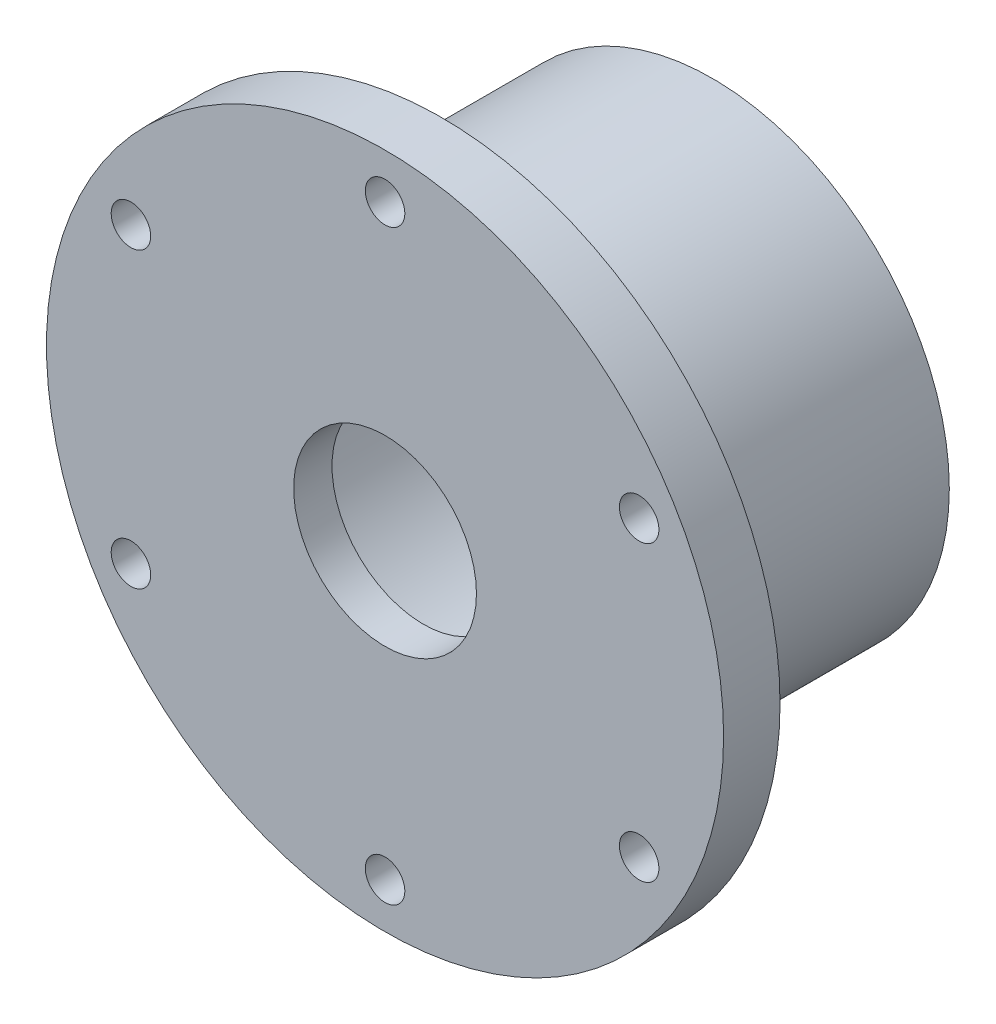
ISO-10303-21;
HEADER;
FILE_DESCRIPTION(('STEP AP214'),'2;1');
FILE_NAME('part.step','',(''),(''),'','','');
FILE_SCHEMA(('AUTOMOTIVE_DESIGN { 1 0 10303 214 1 1 1 1 }'));
ENDSEC;
DATA;
#1=APPLICATION_CONTEXT('core data for automotive mechanical design processes');
#2=APPLICATION_PROTOCOL_DEFINITION('international standard','automotive_design',2000,#1);
#3=PRODUCT_CONTEXT('',#1,'mechanical');
#4=PRODUCT('Part','Part','',(#3));
#5=PRODUCT_RELATED_PRODUCT_CATEGORY('part','',(#4));
#6=PRODUCT_DEFINITION_FORMATION('','',#4);
#7=PRODUCT_DEFINITION_CONTEXT('part definition',#1,'design');
#8=PRODUCT_DEFINITION('design','',#6,#7);
#9=PRODUCT_DEFINITION_SHAPE('','',#8);
#10=(LENGTH_UNIT() NAMED_UNIT(*) SI_UNIT(.MILLI.,.METRE.));
#11=(NAMED_UNIT(*) PLANE_ANGLE_UNIT() SI_UNIT($,.RADIAN.));
#12=(NAMED_UNIT(*) SI_UNIT($,.STERADIAN.) SOLID_ANGLE_UNIT());
#13=UNCERTAINTY_MEASURE_WITH_UNIT(LENGTH_MEASURE(1.E-05),#10,'distance_accuracy_value','');
#14=(GEOMETRIC_REPRESENTATION_CONTEXT(3) GLOBAL_UNCERTAINTY_ASSIGNED_CONTEXT((#13)) GLOBAL_UNIT_ASSIGNED_CONTEXT((#10,
#11,#12)) REPRESENTATION_CONTEXT('',''));
#15=CARTESIAN_POINT('',(0.,0.,0.));
#16=DIRECTION('',(0.,0.,1.));
#17=DIRECTION('',(1.,0.,0.));
#18=AXIS2_PLACEMENT_3D('',#15,#16,#17);
#19=CARTESIAN_POINT('',(0.,0.,0.));
#20=DIRECTION('',(0.,0.,1.));
#21=DIRECTION('',(1.,0.,0.));
#22=AXIS2_PLACEMENT_3D('',#19,#20,#21);
#23=CYLINDRICAL_SURFACE('',#22,69.5);
#24=CARTESIAN_POINT('',(0.,0.,-22.));
#25=DIRECTION('',(0.,0.,1.));
#26=DIRECTION('',(1.,0.,0.));
#27=AXIS2_PLACEMENT_3D('',#24,#25,#26);
#28=CIRCLE('',#27,69.5);
#29=CARTESIAN_POINT('',(69.5,0.,-22.));
#30=VERTEX_POINT('',#29);
#31=EDGE_CURVE('E11',#30,#30,#28,.T.);
#32=ORIENTED_EDGE('',*,*,#31,.F.);
#33=EDGE_LOOP('',(#32));
#34=FACE_BOUND('',#33,.T.);
#35=CARTESIAN_POINT('',(0.,0.,-17.));
#36=DIRECTION('',(0.,0.,1.));
#37=DIRECTION('',(1.,0.,0.));
#38=AXIS2_PLACEMENT_3D('',#35,#36,#37);
#39=CIRCLE('',#38,69.5);
#40=CARTESIAN_POINT('',(69.5,0.,-17.));
#41=VERTEX_POINT('',#40);
#42=EDGE_CURVE('E110',#41,#41,#39,.T.);
#43=ORIENTED_EDGE('',*,*,#42,.T.);
#44=EDGE_LOOP('',(#43));
#45=FACE_BOUND('',#44,.T.);
#46=ADVANCED_FACE('F36',(#34,#45),#23,.F.);
#47=CARTESIAN_POINT('',(0.,69.5,-22.));
#48=DIRECTION('',(0.,0.,1.));
#49=DIRECTION('',(1.,0.,0.));
#50=AXIS2_PLACEMENT_3D('',#47,#48,#49);
#51=PLANE('',#50);
#52=CARTESIAN_POINT('',(0.,0.,-22.));
#53=DIRECTION('',(0.,0.,1.));
#54=DIRECTION('',(1.,0.,0.));
#55=AXIS2_PLACEMENT_3D('',#52,#53,#54);
#56=CIRCLE('',#55,79.5);
#57=CARTESIAN_POINT('',(79.5,0.,-22.));
#58=VERTEX_POINT('',#57);
#59=EDGE_CURVE('E44',#58,#58,#56,.T.);
#60=ORIENTED_EDGE('',*,*,#59,.F.);
#61=EDGE_LOOP('',(#60));
#62=FACE_BOUND('',#61,.T.);
#63=ORIENTED_EDGE('',*,*,#31,.T.);
#64=EDGE_LOOP('',(#63));
#65=FACE_BOUND('',#64,.T.);
#66=ADVANCED_FACE('F139',(#62,#65),#51,.F.);
#67=CARTESIAN_POINT('',(0.,0.,0.));
#68=DIRECTION('',(0.,0.,1.));
#69=DIRECTION('',(1.,0.,0.));
#70=AXIS2_PLACEMENT_3D('',#67,#68,#69);
#71=CYLINDRICAL_SURFACE('',#70,79.5);
#72=CARTESIAN_POINT('',(0.,0.,-145.));
#73=DIRECTION('',(0.,0.,1.));
#74=DIRECTION('',(1.,0.,0.));
#75=AXIS2_PLACEMENT_3D('',#72,#73,#74);
#76=CIRCLE('',#75,79.5);
#77=CARTESIAN_POINT('',(79.5,0.,-145.));
#78=VERTEX_POINT('',#77);
#79=EDGE_CURVE('E131',#78,#78,#76,.T.);
#80=ORIENTED_EDGE('',*,*,#79,.F.);
#81=EDGE_LOOP('',(#80));
#82=FACE_BOUND('',#81,.T.);
#83=ORIENTED_EDGE('',*,*,#59,.T.);
#84=EDGE_LOOP('',(#83));
#85=FACE_BOUND('',#84,.T.);
#86=ADVANCED_FACE('F137',(#82,#85),#71,.F.);
#87=CARTESIAN_POINT('',(0.,105.,-145.));
#88=DIRECTION('',(0.,0.,1.));
#89=DIRECTION('',(1.,0.,0.));
#90=AXIS2_PLACEMENT_3D('',#87,#88,#89);
#91=PLANE('',#90);
#92=CARTESIAN_POINT('',(77.942286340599,45.0000000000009,-145.));
#93=DIRECTION('',(0.,0.,-1.));
#94=DIRECTION('',(-1.,0.,0.));
#95=AXIS2_PLACEMENT_3D('',#92,#93,#94);
#96=CIRCLE('',#95,3.39999999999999);
#97=CARTESIAN_POINT('',(74.542286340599,45.0000000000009,-145.));
#98=VERTEX_POINT('',#97);
#99=EDGE_CURVE('E74',#98,#98,#96,.T.);
#100=ORIENTED_EDGE('',*,*,#99,.F.);
#101=EDGE_LOOP('',(#100));
#102=FACE_BOUND('',#101,.T.);
#103=CARTESIAN_POINT('',(77.9422863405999,-44.9999999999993,-145.));
#104=DIRECTION('',(0.,0.,-1.));
#105=DIRECTION('',(-1.,0.,0.));
#106=AXIS2_PLACEMENT_3D('',#103,#104,#105);
#107=CIRCLE('',#106,3.39999999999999);
#108=CARTESIAN_POINT('',(74.5422863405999,-44.9999999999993,-145.));
#109=VERTEX_POINT('',#108);
#110=EDGE_CURVE('E73',#109,#109,#107,.T.);
#111=ORIENTED_EDGE('',*,*,#110,.F.);
#112=EDGE_LOOP('',(#111));
#113=FACE_BOUND('',#112,.T.);
#114=CARTESIAN_POINT('',(0.,-90.,-145.));
#115=DIRECTION('',(0.,0.,-1.));
#116=DIRECTION('',(-1.,0.,0.));
#117=AXIS2_PLACEMENT_3D('',#114,#115,#116);
#118=CIRCLE('',#117,3.39999999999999);
#119=CARTESIAN_POINT('',(-3.39999999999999,-90.,-145.));
#120=VERTEX_POINT('',#119);
#121=EDGE_CURVE('E86',#120,#120,#118,.T.);
#122=ORIENTED_EDGE('',*,*,#121,.F.);
#123=EDGE_LOOP('',(#122));
#124=FACE_BOUND('',#123,.T.);
#125=CARTESIAN_POINT('',(-77.9422863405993,-45.0000000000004,-145.));
#126=DIRECTION('',(0.,0.,-1.));
#127=DIRECTION('',(-1.,0.,0.));
#128=AXIS2_PLACEMENT_3D('',#125,#126,#127);
#129=CIRCLE('',#128,3.39999999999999);
#130=CARTESIAN_POINT('',(-81.3422863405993,-45.0000000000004,-145.));
#131=VERTEX_POINT('',#130);
#132=EDGE_CURVE('E92',#131,#131,#129,.T.);
#133=ORIENTED_EDGE('',*,*,#132,.F.);
#134=EDGE_LOOP('',(#133));
#135=FACE_BOUND('',#134,.T.);
#136=CARTESIAN_POINT('',(-77.9422863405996,44.9999999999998,-145.));
#137=DIRECTION('',(0.,0.,-1.));
#138=DIRECTION('',(-1.,0.,0.));
#139=AXIS2_PLACEMENT_3D('',#136,#137,#138);
#140=CIRCLE('',#139,3.39999999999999);
#141=CARTESIAN_POINT('',(-81.3422863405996,44.9999999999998,-145.));
#142=VERTEX_POINT('',#141);
#143=EDGE_CURVE('E98',#142,#142,#140,.T.);
#144=ORIENTED_EDGE('',*,*,#143,.F.);
#145=EDGE_LOOP('',(#144));
#146=FACE_BOUND('',#145,.T.);
#147=CARTESIAN_POINT('',(0.,90.,-145.));
#148=DIRECTION('',(0.,0.,-1.));
#149=DIRECTION('',(-1.,0.,0.));
#150=AXIS2_PLACEMENT_3D('',#147,#148,#149);
#151=CIRCLE('',#150,3.39999999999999);
#152=CARTESIAN_POINT('',(-3.39999999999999,90.,-145.));
#153=VERTEX_POINT('',#152);
#154=EDGE_CURVE('E104',#153,#153,#151,.T.);
#155=ORIENTED_EDGE('',*,*,#154,.F.);
#156=EDGE_LOOP('',(#155));
#157=FACE_BOUND('',#156,.T.);
#158=CARTESIAN_POINT('',(0.,0.,-145.));
#159=DIRECTION('',(0.,0.,1.));
#160=DIRECTION('',(1.,0.,0.));
#161=AXIS2_PLACEMENT_3D('',#158,#159,#160);
#162=CIRCLE('',#161,105.);
#163=CARTESIAN_POINT('',(105.,0.,-145.));
#164=VERTEX_POINT('',#163);
#165=EDGE_CURVE('E128',#164,#164,#162,.T.);
#166=ORIENTED_EDGE('',*,*,#165,.F.);
#167=EDGE_LOOP('',(#166));
#168=FACE_BOUND('',#167,.T.);
#169=ORIENTED_EDGE('',*,*,#79,.T.);
#170=EDGE_LOOP('',(#169));
#171=FACE_BOUND('',#170,.T.);
#172=ADVANCED_FACE('F184',(#102,#113,#124,#135,#146,#157,#168,#171),#91,.F.);
#173=CARTESIAN_POINT('',(0.,0.,0.));
#174=DIRECTION('',(0.,0.,1.));
#175=DIRECTION('',(1.,0.,0.));
#176=AXIS2_PLACEMENT_3D('',#173,#174,#175);
#177=CYLINDRICAL_SURFACE('',#176,105.);
#178=CARTESIAN_POINT('',(0.,0.,-25.));
#179=DIRECTION('',(0.,0.,1.));
#180=DIRECTION('',(1.,0.,0.));
#181=AXIS2_PLACEMENT_3D('',#178,#179,#180);
#182=CIRCLE('',#181,105.);
#183=CARTESIAN_POINT('',(105.,0.,-25.));
#184=VERTEX_POINT('',#183);
#185=EDGE_CURVE('E125',#184,#184,#182,.T.);
#186=ORIENTED_EDGE('',*,*,#185,.F.);
#187=EDGE_LOOP('',(#186));
#188=FACE_BOUND('',#187,.T.);
#189=ORIENTED_EDGE('',*,*,#165,.T.);
#190=EDGE_LOOP('',(#189));
#191=FACE_BOUND('',#190,.T.);
#192=ADVANCED_FACE('F177',(#188,#191),#177,.T.);
#193=CARTESIAN_POINT('',(0.,150.,-25.));
#194=DIRECTION('',(0.,0.,1.));
#195=DIRECTION('',(1.,0.,0.));
#196=AXIS2_PLACEMENT_3D('',#193,#194,#195);
#197=PLANE('',#196);
#198=CARTESIAN_POINT('',(112.583302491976,65.0000000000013,-25.));
#199=DIRECTION('',(0.,0.,-1.));
#200=DIRECTION('',(-1.,0.,0.));
#201=AXIS2_PLACEMENT_3D('',#198,#199,#200);
#202=CIRCLE('',#201,8.74999999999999);
#203=CARTESIAN_POINT('',(103.833302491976,65.0000000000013,-25.));
#204=VERTEX_POINT('',#203);
#205=EDGE_CURVE('E265',#204,#204,#202,.T.);
#206=ORIENTED_EDGE('',*,*,#205,.F.);
#207=EDGE_LOOP('',(#206));
#208=FACE_BOUND('',#207,.T.);
#209=CARTESIAN_POINT('',(112.583302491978,-64.999999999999,-25.));
#210=DIRECTION('',(0.,0.,-1.));
#211=DIRECTION('',(-1.,0.,0.));
#212=AXIS2_PLACEMENT_3D('',#209,#210,#211);
#213=CIRCLE('',#212,8.74999999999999);
#214=CARTESIAN_POINT('',(103.833302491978,-64.999999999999,-25.));
#215=VERTEX_POINT('',#214);
#216=EDGE_CURVE('E268',#215,#215,#213,.T.);
#217=ORIENTED_EDGE('',*,*,#216,.F.);
#218=EDGE_LOOP('',(#217));
#219=FACE_BOUND('',#218,.T.);
#220=CARTESIAN_POINT('',(0.,-130.,-25.));
#221=DIRECTION('',(0.,0.,-1.));
#222=DIRECTION('',(-1.,0.,0.));
#223=AXIS2_PLACEMENT_3D('',#220,#221,#222);
#224=CIRCLE('',#223,8.75);
#225=CARTESIAN_POINT('',(-8.75,-130.,-25.));
#226=VERTEX_POINT('',#225);
#227=EDGE_CURVE('E276',#226,#226,#224,.T.);
#228=ORIENTED_EDGE('',*,*,#227,.F.);
#229=EDGE_LOOP('',(#228));
#230=FACE_BOUND('',#229,.T.);
#231=CARTESIAN_POINT('',(-112.583302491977,-65.0000000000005,-25.));
#232=DIRECTION('',(0.,0.,-1.));
#233=DIRECTION('',(-1.,0.,0.));
#234=AXIS2_PLACEMENT_3D('',#231,#232,#233);
#235=CIRCLE('',#234,8.74999999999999);
#236=CARTESIAN_POINT('',(-121.333302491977,-65.0000000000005,-25.));
#237=VERTEX_POINT('',#236);
#238=EDGE_CURVE('E282',#237,#237,#235,.T.);
#239=ORIENTED_EDGE('',*,*,#238,.F.);
#240=EDGE_LOOP('',(#239));
#241=FACE_BOUND('',#240,.T.);
#242=CARTESIAN_POINT('',(-112.583302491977,64.9999999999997,-25.));
#243=DIRECTION('',(0.,0.,-1.));
#244=DIRECTION('',(-1.,0.,0.));
#245=AXIS2_PLACEMENT_3D('',#242,#243,#244);
#246=CIRCLE('',#245,8.74999999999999);
#247=CARTESIAN_POINT('',(-121.333302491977,64.9999999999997,-25.));
#248=VERTEX_POINT('',#247);
#249=EDGE_CURVE('E288',#248,#248,#246,.T.);
#250=ORIENTED_EDGE('',*,*,#249,.F.);
#251=EDGE_LOOP('',(#250));
#252=FACE_BOUND('',#251,.T.);
#253=CARTESIAN_POINT('',(0.,130.,-25.));
#254=DIRECTION('',(0.,0.,-1.));
#255=DIRECTION('',(-1.,0.,0.));
#256=AXIS2_PLACEMENT_3D('',#253,#254,#255);
#257=CIRCLE('',#256,8.75);
#258=CARTESIAN_POINT('',(-8.75,130.,-25.));
#259=VERTEX_POINT('',#258);
#260=EDGE_CURVE('E294',#259,#259,#257,.T.);
#261=ORIENTED_EDGE('',*,*,#260,.F.);
#262=EDGE_LOOP('',(#261));
#263=FACE_BOUND('',#262,.T.);
#264=CARTESIAN_POINT('',(0.,0.,-25.));
#265=DIRECTION('',(0.,0.,1.));
#266=DIRECTION('',(1.,0.,0.));
#267=AXIS2_PLACEMENT_3D('',#264,#265,#266);
#268=CIRCLE('',#267,150.);
#269=CARTESIAN_POINT('',(150.,0.,-25.));
#270=VERTEX_POINT('',#269);
#271=EDGE_CURVE('E122',#270,#270,#268,.T.);
#272=ORIENTED_EDGE('',*,*,#271,.F.);
#273=EDGE_LOOP('',(#272));
#274=FACE_BOUND('',#273,.T.);
#275=ORIENTED_EDGE('',*,*,#185,.T.);
#276=EDGE_LOOP('',(#275));
#277=FACE_BOUND('',#276,.T.);
#278=ADVANCED_FACE('F171',(#208,#219,#230,#241,#252,#263,#274,#277),#197,.F.);
#279=CARTESIAN_POINT('',(0.,0.,0.));
#280=DIRECTION('',(0.,0.,1.));
#281=DIRECTION('',(1.,0.,0.));
#282=AXIS2_PLACEMENT_3D('',#279,#280,#281);
#283=CYLINDRICAL_SURFACE('',#282,150.);
#284=CARTESIAN_POINT('',(0.,0.,0.));
#285=DIRECTION('',(0.,0.,1.));
#286=DIRECTION('',(1.,0.,0.));
#287=AXIS2_PLACEMENT_3D('',#284,#285,#286);
#288=CIRCLE('',#287,150.);
#289=CARTESIAN_POINT('',(150.,0.,0.));
#290=VERTEX_POINT('',#289);
#291=EDGE_CURVE('E119',#290,#290,#288,.T.);
#292=ORIENTED_EDGE('',*,*,#291,.F.);
#293=EDGE_LOOP('',(#292));
#294=FACE_BOUND('',#293,.T.);
#295=ORIENTED_EDGE('',*,*,#271,.T.);
#296=EDGE_LOOP('',(#295));
#297=FACE_BOUND('',#296,.T.);
#298=ADVANCED_FACE('F164',(#294,#297),#283,.T.);
#299=CARTESIAN_POINT('',(0.,150.,0.));
#300=DIRECTION('',(0.,0.,-1.));
#301=DIRECTION('',(-1.,0.,0.));
#302=AXIS2_PLACEMENT_3D('',#299,#300,#301);
#303=PLANE('',#302);
#304=CARTESIAN_POINT('',(112.583302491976,65.0000000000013,0.));
#305=DIRECTION('',(0.,0.,-1.));
#306=DIRECTION('',(-1.,0.,0.));
#307=AXIS2_PLACEMENT_3D('',#304,#305,#306);
#308=CIRCLE('',#307,8.74999999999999);
#309=CARTESIAN_POINT('',(103.833302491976,65.0000000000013,0.));
#310=VERTEX_POINT('',#309);
#311=EDGE_CURVE('E39',#310,#310,#308,.T.);
#312=ORIENTED_EDGE('',*,*,#311,.T.);
#313=EDGE_LOOP('',(#312));
#314=FACE_BOUND('',#313,.T.);
#315=CARTESIAN_POINT('',(112.583302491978,-64.999999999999,0.));
#316=DIRECTION('',(0.,0.,-1.));
#317=DIRECTION('',(-1.,0.,0.));
#318=AXIS2_PLACEMENT_3D('',#315,#316,#317);
#319=CIRCLE('',#318,8.74999999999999);
#320=CARTESIAN_POINT('',(103.833302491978,-64.999999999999,0.));
#321=VERTEX_POINT('',#320);
#322=EDGE_CURVE('E270',#321,#321,#319,.T.);
#323=ORIENTED_EDGE('',*,*,#322,.T.);
#324=EDGE_LOOP('',(#323));
#325=FACE_BOUND('',#324,.T.);
#326=CARTESIAN_POINT('',(0.,-130.,0.));
#327=DIRECTION('',(0.,0.,-1.));
#328=DIRECTION('',(-1.,0.,0.));
#329=AXIS2_PLACEMENT_3D('',#326,#327,#328);
#330=CIRCLE('',#329,8.75);
#331=CARTESIAN_POINT('',(-8.75,-130.,0.));
#332=VERTEX_POINT('',#331);
#333=EDGE_CURVE('E279',#332,#332,#330,.T.);
#334=ORIENTED_EDGE('',*,*,#333,.T.);
#335=EDGE_LOOP('',(#334));
#336=FACE_BOUND('',#335,.T.);
#337=CARTESIAN_POINT('',(-112.583302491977,-65.0000000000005,0.));
#338=DIRECTION('',(0.,0.,-1.));
#339=DIRECTION('',(-1.,0.,0.));
#340=AXIS2_PLACEMENT_3D('',#337,#338,#339);
#341=CIRCLE('',#340,8.74999999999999);
#342=CARTESIAN_POINT('',(-121.333302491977,-65.0000000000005,0.));
#343=VERTEX_POINT('',#342);
#344=EDGE_CURVE('E285',#343,#343,#341,.T.);
#345=ORIENTED_EDGE('',*,*,#344,.T.);
#346=EDGE_LOOP('',(#345));
#347=FACE_BOUND('',#346,.T.);
#348=CARTESIAN_POINT('',(-112.583302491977,64.9999999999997,0.));
#349=DIRECTION('',(0.,0.,-1.));
#350=DIRECTION('',(-1.,0.,0.));
#351=AXIS2_PLACEMENT_3D('',#348,#349,#350);
#352=CIRCLE('',#351,8.74999999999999);
#353=CARTESIAN_POINT('',(-121.333302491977,64.9999999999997,0.));
#354=VERTEX_POINT('',#353);
#355=EDGE_CURVE('E291',#354,#354,#352,.T.);
#356=ORIENTED_EDGE('',*,*,#355,.T.);
#357=EDGE_LOOP('',(#356));
#358=FACE_BOUND('',#357,.T.);
#359=CARTESIAN_POINT('',(0.,130.,0.));
#360=DIRECTION('',(0.,0.,-1.));
#361=DIRECTION('',(-1.,0.,0.));
#362=AXIS2_PLACEMENT_3D('',#359,#360,#361);
#363=CIRCLE('',#362,8.75);
#364=CARTESIAN_POINT('',(-8.75,130.,0.));
#365=VERTEX_POINT('',#364);
#366=EDGE_CURVE('E80',#365,#365,#363,.T.);
#367=ORIENTED_EDGE('',*,*,#366,.T.);
#368=EDGE_LOOP('',(#367));
#369=FACE_BOUND('',#368,.T.);
#370=CARTESIAN_POINT('',(0.,0.,0.));
#371=DIRECTION('',(0.,0.,1.));
#372=DIRECTION('',(1.,0.,0.));
#373=AXIS2_PLACEMENT_3D('',#370,#371,#372);
#374=CIRCLE('',#373,40.5);
#375=CARTESIAN_POINT('',(40.5,0.,0.));
#376=VERTEX_POINT('',#375);
#377=EDGE_CURVE('E116',#376,#376,#374,.T.);
#378=ORIENTED_EDGE('',*,*,#377,.F.);
#379=EDGE_LOOP('',(#378));
#380=FACE_BOUND('',#379,.T.);
#381=ORIENTED_EDGE('',*,*,#291,.T.);
#382=EDGE_LOOP('',(#381));
#383=FACE_BOUND('',#382,.T.);
#384=ADVANCED_FACE('F158',(#314,#325,#336,#347,#358,#369,#380,#383),#303,.F.);
#385=CARTESIAN_POINT('',(0.,0.,0.));
#386=DIRECTION('',(0.,0.,1.));
#387=DIRECTION('',(1.,0.,0.));
#388=AXIS2_PLACEMENT_3D('',#385,#386,#387);
#389=CYLINDRICAL_SURFACE('',#388,40.5);
#390=CARTESIAN_POINT('',(0.,0.,-17.));
#391=DIRECTION('',(0.,0.,1.));
#392=DIRECTION('',(1.,0.,0.));
#393=AXIS2_PLACEMENT_3D('',#390,#391,#392);
#394=CIRCLE('',#393,40.5);
#395=CARTESIAN_POINT('',(40.5,0.,-17.));
#396=VERTEX_POINT('',#395);
#397=EDGE_CURVE('E113',#396,#396,#394,.T.);
#398=ORIENTED_EDGE('',*,*,#397,.F.);
#399=EDGE_LOOP('',(#398));
#400=FACE_BOUND('',#399,.T.);
#401=ORIENTED_EDGE('',*,*,#377,.T.);
#402=EDGE_LOOP('',(#401));
#403=FACE_BOUND('',#402,.T.);
#404=ADVANCED_FACE('F152',(#400,#403),#389,.F.);
#405=CARTESIAN_POINT('',(0.,40.5,-17.));
#406=DIRECTION('',(0.,0.,1.));
#407=DIRECTION('',(1.,0.,0.));
#408=AXIS2_PLACEMENT_3D('',#405,#406,#407);
#409=PLANE('',#408);
#410=ORIENTED_EDGE('',*,*,#42,.F.);
#411=EDGE_LOOP('',(#410));
#412=FACE_BOUND('',#411,.T.);
#413=ORIENTED_EDGE('',*,*,#397,.T.);
#414=EDGE_LOOP('',(#413));
#415=FACE_BOUND('',#414,.T.);
#416=ADVANCED_FACE('F148',(#412,#415),#409,.F.);
#417=CARTESIAN_POINT('',(0.,90.,-119.));
#418=DIRECTION('',(0.,0.,-1.));
#419=DIRECTION('',(-1.,0.,0.));
#420=AXIS2_PLACEMENT_3D('',#417,#418,#419);
#421=CONICAL_SURFACE('',#420,3.39999999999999,1.02974425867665);
#422=CARTESIAN_POINT('',(0.,90.,-116.957073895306));
#423=VERTEX_POINT('',#422);
#424=VERTEX_LOOP('',#423);
#425=FACE_BOUND('',#424,.T.);
#426=CARTESIAN_POINT('',(0.,90.,-119.));
#427=DIRECTION('',(0.,0.,-1.));
#428=DIRECTION('',(-1.,0.,0.));
#429=AXIS2_PLACEMENT_3D('',#426,#427,#428);
#430=CIRCLE('',#429,3.39999999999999);
#431=CARTESIAN_POINT('',(-3.39999999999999,90.,-119.));
#432=VERTEX_POINT('',#431);
#433=EDGE_CURVE('E107',#432,#432,#430,.T.);
#434=ORIENTED_EDGE('',*,*,#433,.T.);
#435=EDGE_LOOP('',(#434));
#436=FACE_BOUND('',#435,.T.);
#437=ADVANCED_FACE('F151',(#425,#436),#421,.F.);
#438=CARTESIAN_POINT('',(0.,90.,-145.));
#439=DIRECTION('',(0.,0.,-1.));
#440=DIRECTION('',(-1.,0.,0.));
#441=AXIS2_PLACEMENT_3D('',#438,#439,#440);
#442=CYLINDRICAL_SURFACE('',#441,3.39999999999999);
#443=ORIENTED_EDGE('',*,*,#433,.F.);
#444=EDGE_LOOP('',(#443));
#445=FACE_BOUND('',#444,.T.);
#446=ORIENTED_EDGE('',*,*,#154,.T.);
#447=EDGE_LOOP('',(#446));
#448=FACE_BOUND('',#447,.T.);
#449=ADVANCED_FACE('F201',(#445,#448),#442,.F.);
#450=CARTESIAN_POINT('',(-77.9422863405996,44.9999999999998,-119.));
#451=DIRECTION('',(0.,0.,-1.));
#452=DIRECTION('',(-1.,0.,0.));
#453=AXIS2_PLACEMENT_3D('',#450,#451,#452);
#454=CONICAL_SURFACE('',#453,3.39999999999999,1.02974425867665);
#455=CARTESIAN_POINT('',(-77.9422863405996,44.9999999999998,-116.957073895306));
#456=VERTEX_POINT('',#455);
#457=VERTEX_LOOP('',#456);
#458=FACE_BOUND('',#457,.T.);
#459=CARTESIAN_POINT('',(-77.9422863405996,44.9999999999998,-119.));
#460=DIRECTION('',(0.,0.,-1.));
#461=DIRECTION('',(-1.,0.,0.));
#462=AXIS2_PLACEMENT_3D('',#459,#460,#461);
#463=CIRCLE('',#462,3.39999999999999);
#464=CARTESIAN_POINT('',(-81.3422863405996,44.9999999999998,-119.));
#465=VERTEX_POINT('',#464);
#466=EDGE_CURVE('E101',#465,#465,#463,.T.);
#467=ORIENTED_EDGE('',*,*,#466,.T.);
#468=EDGE_LOOP('',(#467));
#469=FACE_BOUND('',#468,.T.);
#470=ADVANCED_FACE('F204',(#458,#469),#454,.F.);
#471=CARTESIAN_POINT('',(-77.9422863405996,44.9999999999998,-145.));
#472=DIRECTION('',(0.,0.,-1.));
#473=DIRECTION('',(-1.,0.,0.));
#474=AXIS2_PLACEMENT_3D('',#471,#472,#473);
#475=CYLINDRICAL_SURFACE('',#474,3.39999999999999);
#476=ORIENTED_EDGE('',*,*,#466,.F.);
#477=EDGE_LOOP('',(#476));
#478=FACE_BOUND('',#477,.T.);
#479=ORIENTED_EDGE('',*,*,#143,.T.);
#480=EDGE_LOOP('',(#479));
#481=FACE_BOUND('',#480,.T.);
#482=ADVANCED_FACE('F208',(#478,#481),#475,.F.);
#483=CARTESIAN_POINT('',(-77.9422863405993,-45.0000000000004,-119.));
#484=DIRECTION('',(0.,0.,-1.));
#485=DIRECTION('',(-1.,0.,0.));
#486=AXIS2_PLACEMENT_3D('',#483,#484,#485);
#487=CONICAL_SURFACE('',#486,3.39999999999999,1.02974425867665);
#488=CARTESIAN_POINT('',(-77.9422863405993,-45.0000000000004,-116.957073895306));
#489=VERTEX_POINT('',#488);
#490=VERTEX_LOOP('',#489);
#491=FACE_BOUND('',#490,.T.);
#492=CARTESIAN_POINT('',(-77.9422863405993,-45.0000000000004,-119.));
#493=DIRECTION('',(0.,0.,-1.));
#494=DIRECTION('',(-1.,0.,0.));
#495=AXIS2_PLACEMENT_3D('',#492,#493,#494);
#496=CIRCLE('',#495,3.39999999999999);
#497=CARTESIAN_POINT('',(-81.3422863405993,-45.0000000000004,-119.));
#498=VERTEX_POINT('',#497);
#499=EDGE_CURVE('E95',#498,#498,#496,.T.);
#500=ORIENTED_EDGE('',*,*,#499,.T.);
#501=EDGE_LOOP('',(#500));
#502=FACE_BOUND('',#501,.T.);
#503=ADVANCED_FACE('F211',(#491,#502),#487,.F.);
#504=CARTESIAN_POINT('',(-77.9422863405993,-45.0000000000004,-145.));
#505=DIRECTION('',(0.,0.,-1.));
#506=DIRECTION('',(-1.,0.,0.));
#507=AXIS2_PLACEMENT_3D('',#504,#505,#506);
#508=CYLINDRICAL_SURFACE('',#507,3.39999999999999);
#509=ORIENTED_EDGE('',*,*,#499,.F.);
#510=EDGE_LOOP('',(#509));
#511=FACE_BOUND('',#510,.T.);
#512=ORIENTED_EDGE('',*,*,#132,.T.);
#513=EDGE_LOOP('',(#512));
#514=FACE_BOUND('',#513,.T.);
#515=ADVANCED_FACE('F215',(#511,#514),#508,.F.);
#516=CARTESIAN_POINT('',(0.,-90.,-119.));
#517=DIRECTION('',(0.,0.,-1.));
#518=DIRECTION('',(-1.,0.,0.));
#519=AXIS2_PLACEMENT_3D('',#516,#517,#518);
#520=CONICAL_SURFACE('',#519,3.39999999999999,1.02974425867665);
#521=CARTESIAN_POINT('',(0.,-90.,-116.957073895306));
#522=VERTEX_POINT('',#521);
#523=VERTEX_LOOP('',#522);
#524=FACE_BOUND('',#523,.T.);
#525=CARTESIAN_POINT('',(0.,-90.,-119.));
#526=DIRECTION('',(0.,0.,-1.));
#527=DIRECTION('',(-1.,0.,0.));
#528=AXIS2_PLACEMENT_3D('',#525,#526,#527);
#529=CIRCLE('',#528,3.39999999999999);
#530=CARTESIAN_POINT('',(-3.39999999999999,-90.,-119.));
#531=VERTEX_POINT('',#530);
#532=EDGE_CURVE('E89',#531,#531,#529,.T.);
#533=ORIENTED_EDGE('',*,*,#532,.T.);
#534=EDGE_LOOP('',(#533));
#535=FACE_BOUND('',#534,.T.);
#536=ADVANCED_FACE('F219',(#524,#535),#520,.F.);
#537=CARTESIAN_POINT('',(0.,-90.,-145.));
#538=DIRECTION('',(0.,0.,-1.));
#539=DIRECTION('',(-1.,0.,0.));
#540=AXIS2_PLACEMENT_3D('',#537,#538,#539);
#541=CYLINDRICAL_SURFACE('',#540,3.39999999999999);
#542=ORIENTED_EDGE('',*,*,#532,.F.);
#543=EDGE_LOOP('',(#542));
#544=FACE_BOUND('',#543,.T.);
#545=ORIENTED_EDGE('',*,*,#121,.T.);
#546=EDGE_LOOP('',(#545));
#547=FACE_BOUND('',#546,.T.);
#548=ADVANCED_FACE('F223',(#544,#547),#541,.F.);
#549=CARTESIAN_POINT('',(77.9422863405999,-44.9999999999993,-119.));
#550=DIRECTION('',(0.,0.,-1.));
#551=DIRECTION('',(-1.,0.,0.));
#552=AXIS2_PLACEMENT_3D('',#549,#550,#551);
#553=CONICAL_SURFACE('',#552,3.39999999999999,1.02974425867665);
#554=CARTESIAN_POINT('',(77.9422863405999,-44.9999999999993,-116.957073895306));
#555=VERTEX_POINT('',#554);
#556=VERTEX_LOOP('',#555);
#557=FACE_BOUND('',#556,.T.);
#558=CARTESIAN_POINT('',(77.9422863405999,-44.9999999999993,-119.));
#559=DIRECTION('',(0.,0.,-1.));
#560=DIRECTION('',(-1.,0.,0.));
#561=AXIS2_PLACEMENT_3D('',#558,#559,#560);
#562=CIRCLE('',#561,3.39999999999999);
#563=CARTESIAN_POINT('',(74.5422863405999,-44.9999999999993,-119.));
#564=VERTEX_POINT('',#563);
#565=EDGE_CURVE('E77',#564,#564,#562,.T.);
#566=ORIENTED_EDGE('',*,*,#565,.T.);
#567=EDGE_LOOP('',(#566));
#568=FACE_BOUND('',#567,.T.);
#569=ADVANCED_FACE('F227',(#557,#568),#553,.F.);
#570=CARTESIAN_POINT('',(77.9422863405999,-44.9999999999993,-145.));
#571=DIRECTION('',(0.,0.,-1.));
#572=DIRECTION('',(-1.,0.,0.));
#573=AXIS2_PLACEMENT_3D('',#570,#571,#572);
#574=CYLINDRICAL_SURFACE('',#573,3.39999999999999);
#575=ORIENTED_EDGE('',*,*,#565,.F.);
#576=EDGE_LOOP('',(#575));
#577=FACE_BOUND('',#576,.T.);
#578=ORIENTED_EDGE('',*,*,#110,.T.);
#579=EDGE_LOOP('',(#578));
#580=FACE_BOUND('',#579,.T.);
#581=ADVANCED_FACE('F67',(#577,#580),#574,.F.);
#582=CARTESIAN_POINT('',(77.942286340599,45.0000000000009,-119.));
#583=DIRECTION('',(0.,0.,-1.));
#584=DIRECTION('',(-1.,0.,0.));
#585=AXIS2_PLACEMENT_3D('',#582,#583,#584);
#586=CONICAL_SURFACE('',#585,3.39999999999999,1.02974425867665);
#587=CARTESIAN_POINT('',(77.942286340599,45.0000000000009,-116.957073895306));
#588=VERTEX_POINT('',#587);
#589=VERTEX_LOOP('',#588);
#590=FACE_BOUND('',#589,.T.);
#591=CARTESIAN_POINT('',(77.942286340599,45.0000000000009,-119.));
#592=DIRECTION('',(0.,0.,-1.));
#593=DIRECTION('',(-1.,0.,0.));
#594=AXIS2_PLACEMENT_3D('',#591,#592,#593);
#595=CIRCLE('',#594,3.39999999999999);
#596=CARTESIAN_POINT('',(74.542286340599,45.0000000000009,-119.));
#597=VERTEX_POINT('',#596);
#598=EDGE_CURVE('E71',#597,#597,#595,.T.);
#599=ORIENTED_EDGE('',*,*,#598,.T.);
#600=EDGE_LOOP('',(#599));
#601=FACE_BOUND('',#600,.T.);
#602=ADVANCED_FACE('F63',(#590,#601),#586,.F.);
#603=CARTESIAN_POINT('',(77.942286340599,45.0000000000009,-145.));
#604=DIRECTION('',(0.,0.,-1.));
#605=DIRECTION('',(-1.,0.,0.));
#606=AXIS2_PLACEMENT_3D('',#603,#604,#605);
#607=CYLINDRICAL_SURFACE('',#606,3.39999999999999);
#608=ORIENTED_EDGE('',*,*,#598,.F.);
#609=EDGE_LOOP('',(#608));
#610=FACE_BOUND('',#609,.T.);
#611=ORIENTED_EDGE('',*,*,#99,.T.);
#612=EDGE_LOOP('',(#611));
#613=FACE_BOUND('',#612,.T.);
#614=ADVANCED_FACE('F66',(#610,#613),#607,.F.);
#615=CARTESIAN_POINT('',(0.,130.,-25.));
#616=DIRECTION('',(0.,0.,-1.));
#617=DIRECTION('',(-1.,0.,0.));
#618=AXIS2_PLACEMENT_3D('',#615,#616,#617);
#619=CYLINDRICAL_SURFACE('',#618,8.75);
#620=ORIENTED_EDGE('',*,*,#260,.T.);
#621=EDGE_LOOP('',(#620));
#622=FACE_BOUND('',#621,.T.);
#623=ORIENTED_EDGE('',*,*,#366,.F.);
#624=EDGE_LOOP('',(#623));
#625=FACE_BOUND('',#624,.T.);
#626=ADVANCED_FACE('F237',(#622,#625),#619,.F.);
#627=CARTESIAN_POINT('',(-112.583302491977,64.9999999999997,-25.));
#628=DIRECTION('',(0.,0.,-1.));
#629=DIRECTION('',(-1.,0.,0.));
#630=AXIS2_PLACEMENT_3D('',#627,#628,#629);
#631=CYLINDRICAL_SURFACE('',#630,8.74999999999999);
#632=ORIENTED_EDGE('',*,*,#249,.T.);
#633=EDGE_LOOP('',(#632));
#634=FACE_BOUND('',#633,.T.);
#635=ORIENTED_EDGE('',*,*,#355,.F.);
#636=EDGE_LOOP('',(#635));
#637=FACE_BOUND('',#636,.T.);
#638=ADVANCED_FACE('F240',(#634,#637),#631,.F.);
#639=CARTESIAN_POINT('',(-112.583302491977,-65.0000000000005,-25.));
#640=DIRECTION('',(0.,0.,-1.));
#641=DIRECTION('',(-1.,0.,0.));
#642=AXIS2_PLACEMENT_3D('',#639,#640,#641);
#643=CYLINDRICAL_SURFACE('',#642,8.74999999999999);
#644=ORIENTED_EDGE('',*,*,#238,.T.);
#645=EDGE_LOOP('',(#644));
#646=FACE_BOUND('',#645,.T.);
#647=ORIENTED_EDGE('',*,*,#344,.F.);
#648=EDGE_LOOP('',(#647));
#649=FACE_BOUND('',#648,.T.);
#650=ADVANCED_FACE('F244',(#646,#649),#643,.F.);
#651=CARTESIAN_POINT('',(0.,-130.,-25.));
#652=DIRECTION('',(0.,0.,-1.));
#653=DIRECTION('',(-1.,0.,0.));
#654=AXIS2_PLACEMENT_3D('',#651,#652,#653);
#655=CYLINDRICAL_SURFACE('',#654,8.75);
#656=ORIENTED_EDGE('',*,*,#227,.T.);
#657=EDGE_LOOP('',(#656));
#658=FACE_BOUND('',#657,.T.);
#659=ORIENTED_EDGE('',*,*,#333,.F.);
#660=EDGE_LOOP('',(#659));
#661=FACE_BOUND('',#660,.T.);
#662=ADVANCED_FACE('F248',(#658,#661),#655,.F.);
#663=CARTESIAN_POINT('',(112.583302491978,-64.999999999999,-25.));
#664=DIRECTION('',(0.,0.,-1.));
#665=DIRECTION('',(-1.,0.,0.));
#666=AXIS2_PLACEMENT_3D('',#663,#664,#665);
#667=CYLINDRICAL_SURFACE('',#666,8.74999999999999);
#668=ORIENTED_EDGE('',*,*,#216,.T.);
#669=EDGE_LOOP('',(#668));
#670=FACE_BOUND('',#669,.T.);
#671=ORIENTED_EDGE('',*,*,#322,.F.);
#672=EDGE_LOOP('',(#671));
#673=FACE_BOUND('',#672,.T.);
#674=ADVANCED_FACE('F252',(#670,#673),#667,.F.);
#675=CARTESIAN_POINT('',(112.583302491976,65.0000000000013,-25.));
#676=DIRECTION('',(0.,0.,-1.));
#677=DIRECTION('',(-1.,0.,0.));
#678=AXIS2_PLACEMENT_3D('',#675,#676,#677);
#679=CYLINDRICAL_SURFACE('',#678,8.74999999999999);
#680=ORIENTED_EDGE('',*,*,#205,.T.);
#681=EDGE_LOOP('',(#680));
#682=FACE_BOUND('',#681,.T.);
#683=ORIENTED_EDGE('',*,*,#311,.F.);
#684=EDGE_LOOP('',(#683));
#685=FACE_BOUND('',#684,.T.);
#686=ADVANCED_FACE('F256',(#682,#685),#679,.F.);
#687=CLOSED_SHELL('',(#46,#66,#86,#172,#192,#278,#298,#384,#404,#416,#437,#449,#470,#482,#503,
#515,#536,#548,#569,#581,#602,#614,#626,#638,#650,#662,#674,#686));
#688=MANIFOLD_SOLID_BREP('B2',#687);
#689=ADVANCED_BREP_SHAPE_REPRESENTATION('',(#18,#688),#14);
#690=SHAPE_DEFINITION_REPRESENTATION(#9,#689);
ENDSEC;
END-ISO-10303-21;
